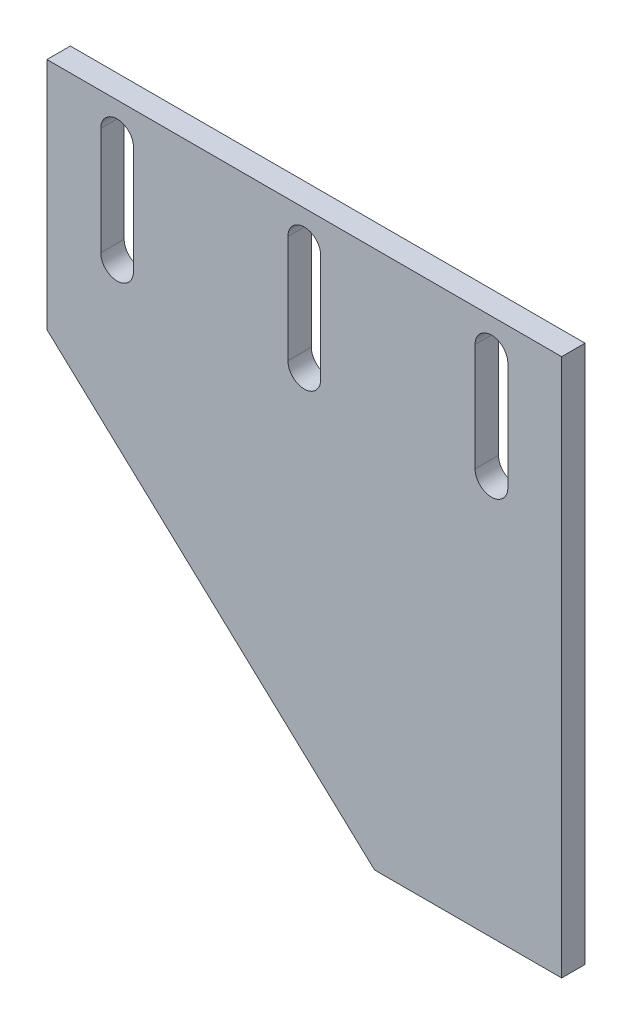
from build123d import *

# Parameters (mm, degrees)
EXTRUSION1_DEPTH = 10


with BuildPart() as part:
    # Esquisse1 → Extrusion1 (new body)
    with BuildSketch(Plane.XY):
        Polygon((-110, 15), (30, -115), (110, -115), (110, 115), (-110, 115), align=None)
        with BuildLine():
            Line((87, 101), (87, 55))
            ThreePointArc((87, 55), (80, 48), (73, 55))
            Line((73, 55), (73, 101))
            ThreePointArc((73, 101), (80, 108), (87, 101))
        make_face(mode=Mode.SUBTRACT)
        with BuildLine():
            Line((7, 101), (7, 55))
            ThreePointArc((7, 55), (0, 48), (-7, 55))
            Line((-7, 55), (-7, 101))
            ThreePointArc((-7, 101), (0, 108), (7, 101))
        make_face(mode=Mode.SUBTRACT)
        with BuildLine():
            Line((-73, 101), (-73, 55))
            ThreePointArc((-73, 55), (-80, 48), (-87, 55))
            Line((-87, 55), (-87, 101))
            ThreePointArc((-87, 101), (-80, 108), (-73, 101))
        make_face(mode=Mode.SUBTRACT)
    extrude(amount=EXTRUSION1_DEPTH)


solid = part.part
